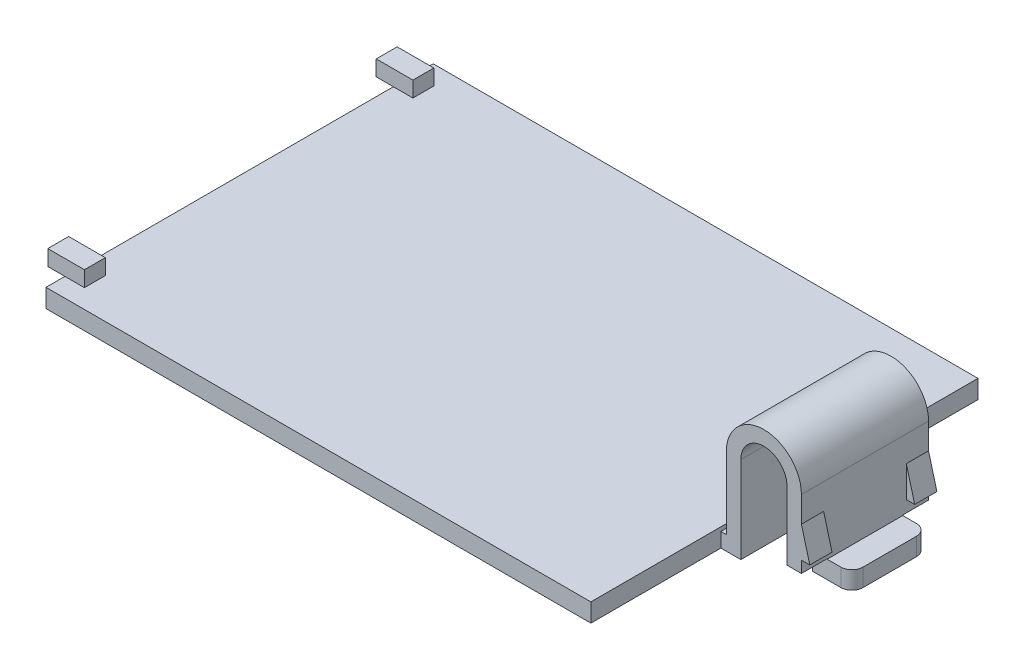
ISO-10303-21;
HEADER;
FILE_DESCRIPTION(('STEP AP214'),'2;1');
FILE_NAME('part.step','',(''),(''),'','','');
FILE_SCHEMA(('AUTOMOTIVE_DESIGN { 1 0 10303 214 1 1 1 1 }'));
ENDSEC;
DATA;
#1=APPLICATION_CONTEXT('core data for automotive mechanical design processes');
#2=APPLICATION_PROTOCOL_DEFINITION('international standard','automotive_design',2000,#1);
#3=PRODUCT_CONTEXT('',#1,'mechanical');
#4=PRODUCT('Part','Part','',(#3));
#5=PRODUCT_RELATED_PRODUCT_CATEGORY('part','',(#4));
#6=PRODUCT_DEFINITION_FORMATION('','',#4);
#7=PRODUCT_DEFINITION_CONTEXT('part definition',#1,'design');
#8=PRODUCT_DEFINITION('design','',#6,#7);
#9=PRODUCT_DEFINITION_SHAPE('','',#8);
#10=(LENGTH_UNIT() NAMED_UNIT(*) SI_UNIT(.MILLI.,.METRE.));
#11=(NAMED_UNIT(*) PLANE_ANGLE_UNIT() SI_UNIT($,.RADIAN.));
#12=(NAMED_UNIT(*) SI_UNIT($,.STERADIAN.) SOLID_ANGLE_UNIT());
#13=UNCERTAINTY_MEASURE_WITH_UNIT(LENGTH_MEASURE(1.E-05),#10,'distance_accuracy_value','');
#14=(GEOMETRIC_REPRESENTATION_CONTEXT(3) GLOBAL_UNCERTAINTY_ASSIGNED_CONTEXT((#13)) GLOBAL_UNIT_ASSIGNED_CONTEXT((#10,
#11,#12)) REPRESENTATION_CONTEXT('',''));
#15=CARTESIAN_POINT('',(0.,0.,0.));
#16=DIRECTION('',(0.,0.,1.));
#17=DIRECTION('',(1.,0.,0.));
#18=AXIS2_PLACEMENT_3D('',#15,#16,#17);
#19=CARTESIAN_POINT('',(7.24909040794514,7.8,5.72));
#20=DIRECTION('',(1.,0.,0.));
#21=DIRECTION('',(0.,0.,-1.));
#22=AXIS2_PLACEMENT_3D('',#19,#20,#21);
#23=PLANE('',#22);
#24=DIRECTION('',(0.,1.,0.));
#25=VECTOR('',#24,1.);
#26=CARTESIAN_POINT('',(7.24909040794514,7.8,5.72));
#27=LINE('',#26,#25);
#28=CARTESIAN_POINT('',(7.24909040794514,7.8,5.72));
#29=VERTEX_POINT('',#28);
#30=CARTESIAN_POINT('',(7.24909040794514,5.48641138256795,5.72));
#31=VERTEX_POINT('',#30);
#32=EDGE_CURVE('E283',#29,#31,#27,.F.);
#33=ORIENTED_EDGE('',*,*,#32,.T.);
#34=DIRECTION('',(0.,0.,1.));
#35=VECTOR('',#34,1.);
#36=CARTESIAN_POINT('',(7.24909040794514,5.48641138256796,3.72));
#37=LINE('',#36,#35);
#38=CARTESIAN_POINT('',(7.24909040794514,5.48641138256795,3.72));
#39=VERTEX_POINT('',#38);
#40=EDGE_CURVE('E44',#39,#31,#37,.T.);
#41=ORIENTED_EDGE('',*,*,#40,.F.);
#42=DIRECTION('',(0.,1.,0.));
#43=VECTOR('',#42,1.);
#44=CARTESIAN_POINT('',(7.24909040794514,5.48641138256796,3.72));
#45=LINE('',#44,#43);
#46=CARTESIAN_POINT('',(7.24909040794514,2.68538830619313,3.72));
#47=VERTEX_POINT('',#46);
#48=EDGE_CURVE('E49',#47,#39,#45,.T.);
#49=ORIENTED_EDGE('',*,*,#48,.F.);
#50=DIRECTION('',(0.,0.,1.));
#51=VECTOR('',#50,1.);
#52=CARTESIAN_POINT('',(7.24909040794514,2.68538830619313,3.72));
#53=LINE('',#52,#51);
#54=CARTESIAN_POINT('',(7.24909040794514,2.68538830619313,5.72));
#55=VERTEX_POINT('',#54);
#56=EDGE_CURVE('E287',#47,#55,#53,.T.);
#57=ORIENTED_EDGE('',*,*,#56,.T.);
#58=CARTESIAN_POINT('',(7.24909040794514,1.64386983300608,5.72));
#59=VERTEX_POINT('',#58);
#60=EDGE_CURVE('E274',#55,#59,#27,.F.);
#61=ORIENTED_EDGE('',*,*,#60,.T.);
#62=DIRECTION('',(0.,0.,1.));
#63=VECTOR('',#62,1.);
#64=CARTESIAN_POINT('',(7.24909040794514,1.64386983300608,5.72));
#65=LINE('',#64,#63);
#66=CARTESIAN_POINT('',(7.24909040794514,1.64386983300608,3.4));
#67=VERTEX_POINT('',#66);
#68=EDGE_CURVE('E334',#67,#59,#65,.T.);
#69=ORIENTED_EDGE('',*,*,#68,.F.);
#70=DIRECTION('',(0.,1.,0.));
#71=VECTOR('',#70,1.);
#72=CARTESIAN_POINT('',(7.24909040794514,1.64386983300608,3.4));
#73=LINE('',#72,#71);
#74=CARTESIAN_POINT('',(7.24909040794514,1.6,3.4));
#75=VERTEX_POINT('',#74);
#76=EDGE_CURVE('E336',#75,#67,#73,.T.);
#77=ORIENTED_EDGE('',*,*,#76,.F.);
#78=DIRECTION('',(0.,0.,1.));
#79=VECTOR('',#78,1.);
#80=CARTESIAN_POINT('',(7.24909040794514,1.6,-3.4));
#81=LINE('',#80,#79);
#82=CARTESIAN_POINT('',(7.24909040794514,1.6,-3.4));
#83=VERTEX_POINT('',#82);
#84=EDGE_CURVE('E368',#83,#75,#81,.T.);
#85=ORIENTED_EDGE('',*,*,#84,.F.);
#86=DIRECTION('',(0.,-1.,0.));
#87=VECTOR('',#86,1.);
#88=CARTESIAN_POINT('',(7.24909040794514,1.64386983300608,-3.4));
#89=LINE('',#88,#87);
#90=CARTESIAN_POINT('',(7.24909040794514,1.64386983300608,-3.4));
#91=VERTEX_POINT('',#90);
#92=EDGE_CURVE('E348',#91,#83,#89,.T.);
#93=ORIENTED_EDGE('',*,*,#92,.F.);
#94=DIRECTION('',(0.,0.,1.));
#95=VECTOR('',#94,1.);
#96=CARTESIAN_POINT('',(7.24909040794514,1.64386983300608,-5.72));
#97=LINE('',#96,#95);
#98=CARTESIAN_POINT('',(7.24909040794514,1.64386983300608,-5.72));
#99=VERTEX_POINT('',#98);
#100=EDGE_CURVE('E345',#99,#91,#97,.T.);
#101=ORIENTED_EDGE('',*,*,#100,.F.);
#102=DIRECTION('',(0.,1.,0.));
#103=VECTOR('',#102,1.);
#104=CARTESIAN_POINT('',(7.24909040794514,7.8,-5.72));
#105=LINE('',#104,#103);
#106=CARTESIAN_POINT('',(7.24909040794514,2.68538830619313,-5.72));
#107=VERTEX_POINT('',#106);
#108=EDGE_CURVE('E397',#107,#99,#105,.F.);
#109=ORIENTED_EDGE('',*,*,#108,.F.);
#110=DIRECTION('',(0.,0.,-1.));
#111=VECTOR('',#110,1.);
#112=CARTESIAN_POINT('',(7.24909040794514,2.68538830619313,-3.72));
#113=LINE('',#112,#111);
#114=CARTESIAN_POINT('',(7.24909040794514,2.68538830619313,-3.72));
#115=VERTEX_POINT('',#114);
#116=EDGE_CURVE('E321',#115,#107,#113,.T.);
#117=ORIENTED_EDGE('',*,*,#116,.F.);
#118=DIRECTION('',(0.,1.,0.));
#119=VECTOR('',#118,1.);
#120=CARTESIAN_POINT('',(7.24909040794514,5.48641138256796,-3.72));
#121=LINE('',#120,#119);
#122=CARTESIAN_POINT('',(7.24909040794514,5.48641138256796,-3.72));
#123=VERTEX_POINT('',#122);
#124=EDGE_CURVE('E311',#115,#123,#121,.T.);
#125=ORIENTED_EDGE('',*,*,#124,.T.);
#126=DIRECTION('',(0.,0.,-1.));
#127=VECTOR('',#126,1.);
#128=CARTESIAN_POINT('',(7.24909040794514,5.48641138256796,-3.72));
#129=LINE('',#128,#127);
#130=CARTESIAN_POINT('',(7.24909040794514,5.48641138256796,-5.72));
#131=VERTEX_POINT('',#130);
#132=EDGE_CURVE('E320',#123,#131,#129,.T.);
#133=ORIENTED_EDGE('',*,*,#132,.T.);
#134=CARTESIAN_POINT('',(7.24909040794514,7.8,-5.72));
#135=VERTEX_POINT('',#134);
#136=EDGE_CURVE('E398',#135,#131,#105,.F.);
#137=ORIENTED_EDGE('',*,*,#136,.F.);
#138=DIRECTION('',(0.,0.,-1.));
#139=VECTOR('',#138,1.);
#140=CARTESIAN_POINT('',(7.24909040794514,7.8,5.72));
#141=LINE('',#140,#139);
#142=EDGE_CURVE('E448',#29,#135,#141,.T.);
#143=ORIENTED_EDGE('',*,*,#142,.F.);
#144=EDGE_LOOP('',(#33,#41,#49,#57,#61,#69,#77,#85,#93,#101,#109,#117,#125,#133,#137,#143));
#145=FACE_BOUND('',#144,.T.);
#146=ADVANCED_FACE('F26',(#145),#23,.T.);
#147=CARTESIAN_POINT('',(0.,1.66,17.42));
#148=DIRECTION('',(-1.,0.,0.));
#149=DIRECTION('',(0.,0.,1.));
#150=AXIS2_PLACEMENT_3D('',#147,#148,#149);
#151=PLANE('',#150);
#152=DIRECTION('',(0.,1.,0.));
#153=VECTOR('',#152,1.);
#154=CARTESIAN_POINT('',(0.,0.,-5.72));
#155=LINE('',#154,#153);
#156=CARTESIAN_POINT('',(0.,0.,-5.72));
#157=VERTEX_POINT('',#156);
#158=CARTESIAN_POINT('',(0.,1.3,-5.72));
#159=VERTEX_POINT('',#158);
#160=EDGE_CURVE('E30',#157,#159,#155,.T.);
#161=ORIENTED_EDGE('',*,*,#160,.F.);
#162=DIRECTION('',(0.,0.,-1.));
#163=VECTOR('',#162,1.);
#164=CARTESIAN_POINT('',(0.,0.,17.42));
#165=LINE('',#164,#163);
#166=CARTESIAN_POINT('',(0.,0.,-17.42));
#167=VERTEX_POINT('',#166);
#168=EDGE_CURVE('E518',#157,#167,#165,.T.);
#169=ORIENTED_EDGE('',*,*,#168,.T.);
#170=DIRECTION('',(0.,-1.,0.));
#171=VECTOR('',#170,1.);
#172=CARTESIAN_POINT('',(0.,1.66,-17.42));
#173=LINE('',#172,#171);
#174=CARTESIAN_POINT('',(0.,1.66,-17.42));
#175=VERTEX_POINT('',#174);
#176=EDGE_CURVE('E530',#175,#167,#173,.T.);
#177=ORIENTED_EDGE('',*,*,#176,.F.);
#178=DIRECTION('',(0.,0.,-1.));
#179=VECTOR('',#178,1.);
#180=CARTESIAN_POINT('',(0.,1.66,17.42));
#181=LINE('',#180,#179);
#182=CARTESIAN_POINT('',(0.,1.66,17.42));
#183=VERTEX_POINT('',#182);
#184=EDGE_CURVE('E553',#183,#175,#181,.T.);
#185=ORIENTED_EDGE('',*,*,#184,.F.);
#186=DIRECTION('',(0.,-1.,0.));
#187=VECTOR('',#186,1.);
#188=CARTESIAN_POINT('',(0.,1.66,17.42));
#189=LINE('',#188,#187);
#190=CARTESIAN_POINT('',(0.,0.,17.42));
#191=VERTEX_POINT('',#190);
#192=EDGE_CURVE('E539',#183,#191,#189,.T.);
#193=ORIENTED_EDGE('',*,*,#192,.T.);
#194=CARTESIAN_POINT('',(0.,0.,5.72));
#195=VERTEX_POINT('',#194);
#196=EDGE_CURVE('E527',#191,#195,#165,.T.);
#197=ORIENTED_EDGE('',*,*,#196,.T.);
#198=DIRECTION('',(0.,1.,0.));
#199=VECTOR('',#198,1.);
#200=CARTESIAN_POINT('',(0.,0.,5.72));
#201=LINE('',#200,#199);
#202=CARTESIAN_POINT('',(0.,1.3,5.72));
#203=VERTEX_POINT('',#202);
#204=EDGE_CURVE('E426',#195,#203,#201,.T.);
#205=ORIENTED_EDGE('',*,*,#204,.T.);
#206=DIRECTION('',(0.,0.,-1.));
#207=VECTOR('',#206,1.);
#208=CARTESIAN_POINT('',(0.,1.3,5.72));
#209=LINE('',#208,#207);
#210=EDGE_CURVE('E441',#203,#159,#209,.T.);
#211=ORIENTED_EDGE('',*,*,#210,.T.);
#212=EDGE_LOOP('',(#161,#169,#177,#185,#193,#197,#205,#211));
#213=FACE_BOUND('',#212,.T.);
#214=ADVANCED_FACE('F28',(#213),#151,.F.);
#215=CARTESIAN_POINT('',(0.,1.66,-17.42));
#216=DIRECTION('',(0.,1.,0.));
#217=DIRECTION('',(0.,0.,1.));
#218=AXIS2_PLACEMENT_3D('',#215,#216,#217);
#219=PLANE('',#218);
#220=DIRECTION('',(0.,0.,-1.));
#221=VECTOR('',#220,1.);
#222=CARTESIAN_POINT('',(-47.2715400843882,1.66,-13.84));
#223=LINE('',#222,#221);
#224=CARTESIAN_POINT('',(-47.2715400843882,1.66,-13.84));
#225=VERTEX_POINT('',#224);
#226=CARTESIAN_POINT('',(-47.2715400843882,1.66,-15.72));
#227=VERTEX_POINT('',#226);
#228=EDGE_CURVE('E455',#225,#227,#223,.T.);
#229=ORIENTED_EDGE('',*,*,#228,.F.);
#230=DIRECTION('',(-1.,0.,0.));
#231=VECTOR('',#230,1.);
#232=CARTESIAN_POINT('',(0.,1.66,-13.84));
#233=LINE('',#232,#231);
#234=CARTESIAN_POINT('',(-49.03,1.66,-13.84));
#235=VERTEX_POINT('',#234);
#236=EDGE_CURVE('E11',#225,#235,#233,.T.);
#237=ORIENTED_EDGE('',*,*,#236,.T.);
#238=DIRECTION('',(0.,0.,1.));
#239=VECTOR('',#238,1.);
#240=CARTESIAN_POINT('',(-49.03,1.66,17.42));
#241=LINE('',#240,#239);
#242=CARTESIAN_POINT('',(-49.03,1.66,13.84));
#243=VERTEX_POINT('',#242);
#244=EDGE_CURVE('E548',#235,#243,#241,.T.);
#245=ORIENTED_EDGE('',*,*,#244,.T.);
#246=DIRECTION('',(-1.,0.,0.));
#247=VECTOR('',#246,1.);
#248=CARTESIAN_POINT('',(-50.5715400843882,1.66,13.84));
#249=LINE('',#248,#247);
#250=CARTESIAN_POINT('',(-47.2715400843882,1.66,13.84));
#251=VERTEX_POINT('',#250);
#252=EDGE_CURVE('E494',#251,#243,#249,.T.);
#253=ORIENTED_EDGE('',*,*,#252,.F.);
#254=DIRECTION('',(0.,0.,-1.));
#255=VECTOR('',#254,1.);
#256=CARTESIAN_POINT('',(-47.2715400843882,1.66,13.84));
#257=LINE('',#256,#255);
#258=CARTESIAN_POINT('',(-47.2715400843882,1.66,15.72));
#259=VERTEX_POINT('',#258);
#260=EDGE_CURVE('E490',#259,#251,#257,.T.);
#261=ORIENTED_EDGE('',*,*,#260,.F.);
#262=DIRECTION('',(1.,0.,0.));
#263=VECTOR('',#262,1.);
#264=CARTESIAN_POINT('',(-50.5715400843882,1.66,15.72));
#265=LINE('',#264,#263);
#266=CARTESIAN_POINT('',(-49.03,1.66,15.72));
#267=VERTEX_POINT('',#266);
#268=EDGE_CURVE('E36',#267,#259,#265,.T.);
#269=ORIENTED_EDGE('',*,*,#268,.F.);
#270=CARTESIAN_POINT('',(-49.03,1.66,17.42));
#271=VERTEX_POINT('',#270);
#272=EDGE_CURVE('E552',#267,#271,#241,.T.);
#273=ORIENTED_EDGE('',*,*,#272,.T.);
#274=DIRECTION('',(1.,0.,0.));
#275=VECTOR('',#274,1.);
#276=CARTESIAN_POINT('',(0.,1.66,17.42));
#277=LINE('',#276,#275);
#278=EDGE_CURVE('E542',#271,#183,#277,.T.);
#279=ORIENTED_EDGE('',*,*,#278,.T.);
#280=ORIENTED_EDGE('',*,*,#184,.T.);
#281=DIRECTION('',(-1.,0.,0.));
#282=VECTOR('',#281,1.);
#283=CARTESIAN_POINT('',(0.,1.66,-17.42));
#284=LINE('',#283,#282);
#285=CARTESIAN_POINT('',(-49.03,1.66,-17.42));
#286=VERTEX_POINT('',#285);
#287=EDGE_CURVE('E550',#175,#286,#284,.T.);
#288=ORIENTED_EDGE('',*,*,#287,.T.);
#289=CARTESIAN_POINT('',(-49.03,1.66,-15.72));
#290=VERTEX_POINT('',#289);
#291=EDGE_CURVE('E544',#286,#290,#241,.T.);
#292=ORIENTED_EDGE('',*,*,#291,.T.);
#293=DIRECTION('',(-1.,0.,0.));
#294=VECTOR('',#293,1.);
#295=CARTESIAN_POINT('',(-50.5715400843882,1.66,-15.72));
#296=LINE('',#295,#294);
#297=EDGE_CURVE('E459',#227,#290,#296,.T.);
#298=ORIENTED_EDGE('',*,*,#297,.F.);
#299=EDGE_LOOP('',(#229,#237,#245,#253,#261,#269,#273,#279,#280,#288,#292,#298));
#300=FACE_BOUND('',#299,.T.);
#301=ADVANCED_FACE('F584',(#300),#219,.T.);
#302=CARTESIAN_POINT('',(0.,1.66,-17.42));
#303=DIRECTION('',(0.,0.,1.));
#304=DIRECTION('',(1.,0.,0.));
#305=AXIS2_PLACEMENT_3D('',#302,#303,#304);
#306=PLANE('',#305);
#307=DIRECTION('',(-1.,0.,0.));
#308=VECTOR('',#307,1.);
#309=CARTESIAN_POINT('',(0.,0.,-17.42));
#310=LINE('',#309,#308);
#311=CARTESIAN_POINT('',(-49.03,0.,-17.42));
#312=VERTEX_POINT('',#311);
#313=EDGE_CURVE('E521',#167,#312,#310,.T.);
#314=ORIENTED_EDGE('',*,*,#313,.T.);
#315=DIRECTION('',(0.,-1.,0.));
#316=VECTOR('',#315,1.);
#317=CARTESIAN_POINT('',(-49.03,1.66,-17.42));
#318=LINE('',#317,#316);
#319=EDGE_CURVE('E533',#286,#312,#318,.T.);
#320=ORIENTED_EDGE('',*,*,#319,.F.);
#321=ORIENTED_EDGE('',*,*,#287,.F.);
#322=ORIENTED_EDGE('',*,*,#176,.T.);
#323=EDGE_LOOP('',(#314,#320,#321,#322));
#324=FACE_BOUND('',#323,.T.);
#325=ADVANCED_FACE('F564',(#324),#306,.F.);
#326=CARTESIAN_POINT('',(-49.03,1.66,17.42));
#327=DIRECTION('',(1.,0.,0.));
#328=DIRECTION('',(0.,0.,-1.));
#329=AXIS2_PLACEMENT_3D('',#326,#327,#328);
#330=PLANE('',#329);
#331=DIRECTION('',(0.,0.,1.));
#332=VECTOR('',#331,1.);
#333=CARTESIAN_POINT('',(-49.03,0.,17.42));
#334=LINE('',#333,#332);
#335=CARTESIAN_POINT('',(-49.03,0.,17.42));
#336=VERTEX_POINT('',#335);
#337=EDGE_CURVE('E557',#312,#336,#334,.T.);
#338=ORIENTED_EDGE('',*,*,#337,.T.);
#339=DIRECTION('',(0.,-1.,0.));
#340=VECTOR('',#339,1.);
#341=CARTESIAN_POINT('',(-49.03,1.66,17.42));
#342=LINE('',#341,#340);
#343=EDGE_CURVE('E536',#271,#336,#342,.T.);
#344=ORIENTED_EDGE('',*,*,#343,.F.);
#345=ORIENTED_EDGE('',*,*,#272,.F.);
#346=EDGE_CURVE('E549',#243,#267,#241,.T.);
#347=ORIENTED_EDGE('',*,*,#346,.F.);
#348=ORIENTED_EDGE('',*,*,#244,.F.);
#349=EDGE_CURVE('E547',#290,#235,#241,.T.);
#350=ORIENTED_EDGE('',*,*,#349,.F.);
#351=ORIENTED_EDGE('',*,*,#291,.F.);
#352=ORIENTED_EDGE('',*,*,#319,.T.);
#353=EDGE_LOOP('',(#338,#344,#345,#347,#348,#350,#351,#352));
#354=FACE_BOUND('',#353,.T.);
#355=ADVANCED_FACE('F569',(#354),#330,.F.);
#356=CARTESIAN_POINT('',(0.,1.66,17.42));
#357=DIRECTION('',(0.,0.,-1.));
#358=DIRECTION('',(-1.,0.,0.));
#359=AXIS2_PLACEMENT_3D('',#356,#357,#358);
#360=PLANE('',#359);
#361=DIRECTION('',(1.,0.,0.));
#362=VECTOR('',#361,1.);
#363=CARTESIAN_POINT('',(0.,0.,17.42));
#364=LINE('',#363,#362);
#365=EDGE_CURVE('E556',#336,#191,#364,.T.);
#366=ORIENTED_EDGE('',*,*,#365,.T.);
#367=ORIENTED_EDGE('',*,*,#192,.F.);
#368=ORIENTED_EDGE('',*,*,#278,.F.);
#369=ORIENTED_EDGE('',*,*,#343,.T.);
#370=EDGE_LOOP('',(#366,#367,#368,#369));
#371=FACE_BOUND('',#370,.T.);
#372=ADVANCED_FACE('F576',(#371),#360,.F.);
#373=CARTESIAN_POINT('',(0.,0.,-17.42));
#374=DIRECTION('',(0.,1.,0.));
#375=DIRECTION('',(0.,0.,1.));
#376=AXIS2_PLACEMENT_3D('',#373,#374,#375);
#377=PLANE('',#376);
#378=ORIENTED_EDGE('',*,*,#196,.F.);
#379=ORIENTED_EDGE('',*,*,#365,.F.);
#380=ORIENTED_EDGE('',*,*,#337,.F.);
#381=ORIENTED_EDGE('',*,*,#313,.F.);
#382=ORIENTED_EDGE('',*,*,#168,.F.);
#383=DIRECTION('',(1.,0.,0.));
#384=VECTOR('',#383,1.);
#385=CARTESIAN_POINT('',(0.,0.,-5.72));
#386=LINE('',#385,#384);
#387=CARTESIAN_POINT('',(1.79857073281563,0.,-5.72));
#388=VERTEX_POINT('',#387);
#389=EDGE_CURVE('E414',#157,#388,#386,.T.);
#390=ORIENTED_EDGE('',*,*,#389,.T.);
#391=DIRECTION('',(0.,0.,-1.));
#392=VECTOR('',#391,1.);
#393=CARTESIAN_POINT('',(1.79857073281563,0.,5.72));
#394=LINE('',#393,#392);
#395=CARTESIAN_POINT('',(1.79857073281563,0.,5.72));
#396=VERTEX_POINT('',#395);
#397=EDGE_CURVE('E438',#396,#388,#394,.T.);
#398=ORIENTED_EDGE('',*,*,#397,.F.);
#399=DIRECTION('',(1.,0.,0.));
#400=VECTOR('',#399,1.);
#401=CARTESIAN_POINT('',(0.,0.,5.72));
#402=LINE('',#401,#400);
#403=EDGE_CURVE('E430',#195,#396,#402,.T.);
#404=ORIENTED_EDGE('',*,*,#403,.F.);
#405=EDGE_LOOP('',(#378,#379,#380,#381,#382,#390,#398,#404));
#406=FACE_BOUND('',#405,.T.);
#407=ADVANCED_FACE('F573',(#406),#377,.F.);
#408=CARTESIAN_POINT('',(-50.5715400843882,1.66,15.72));
#409=DIRECTION('',(0.,1.,0.));
#410=DIRECTION('',(0.,0.,1.));
#411=AXIS2_PLACEMENT_3D('',#408,#409,#410);
#412=PLANE('',#411);
#413=CARTESIAN_POINT('',(-50.5715400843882,1.66,13.84));
#414=VERTEX_POINT('',#413);
#415=EDGE_CURVE('E493',#243,#414,#249,.T.);
#416=ORIENTED_EDGE('',*,*,#415,.F.);
#417=ORIENTED_EDGE('',*,*,#346,.T.);
#418=CARTESIAN_POINT('',(-50.5715400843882,1.66,15.72));
#419=VERTEX_POINT('',#418);
#420=EDGE_CURVE('E487',#419,#267,#265,.T.);
#421=ORIENTED_EDGE('',*,*,#420,.F.);
#422=DIRECTION('',(0.,0.,1.));
#423=VECTOR('',#422,1.);
#424=CARTESIAN_POINT('',(-50.5715400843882,1.66,13.84));
#425=LINE('',#424,#423);
#426=EDGE_CURVE('E484',#414,#419,#425,.T.);
#427=ORIENTED_EDGE('',*,*,#426,.F.);
#428=EDGE_LOOP('',(#416,#417,#421,#427));
#429=FACE_BOUND('',#428,.T.);
#430=ADVANCED_FACE('F595',(#429),#412,.F.);
#431=CARTESIAN_POINT('',(-50.5715400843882,3.06,13.84));
#432=DIRECTION('',(1.,0.,0.));
#433=DIRECTION('',(0.,0.,-1.));
#434=AXIS2_PLACEMENT_3D('',#431,#432,#433);
#435=PLANE('',#434);
#436=ORIENTED_EDGE('',*,*,#426,.T.);
#437=DIRECTION('',(0.,-1.,0.));
#438=VECTOR('',#437,1.);
#439=CARTESIAN_POINT('',(-50.5715400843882,3.06,15.72));
#440=LINE('',#439,#438);
#441=CARTESIAN_POINT('',(-50.5715400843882,3.06,15.72));
#442=VERTEX_POINT('',#441);
#443=EDGE_CURVE('E515',#442,#419,#440,.T.);
#444=ORIENTED_EDGE('',*,*,#443,.F.);
#445=DIRECTION('',(0.,0.,1.));
#446=VECTOR('',#445,1.);
#447=CARTESIAN_POINT('',(-50.5715400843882,3.06,13.84));
#448=LINE('',#447,#446);
#449=CARTESIAN_POINT('',(-50.5715400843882,3.06,13.84));
#450=VERTEX_POINT('',#449);
#451=EDGE_CURVE('E497',#450,#442,#448,.T.);
#452=ORIENTED_EDGE('',*,*,#451,.F.);
#453=DIRECTION('',(0.,-1.,0.));
#454=VECTOR('',#453,1.);
#455=CARTESIAN_POINT('',(-50.5715400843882,3.06,13.84));
#456=LINE('',#455,#454);
#457=EDGE_CURVE('E506',#450,#414,#456,.T.);
#458=ORIENTED_EDGE('',*,*,#457,.T.);
#459=EDGE_LOOP('',(#436,#444,#452,#458));
#460=FACE_BOUND('',#459,.T.);
#461=ADVANCED_FACE('F610',(#460),#435,.F.);
#462=CARTESIAN_POINT('',(-50.5715400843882,3.06,15.72));
#463=DIRECTION('',(0.,0.,-1.));
#464=DIRECTION('',(-1.,0.,0.));
#465=AXIS2_PLACEMENT_3D('',#462,#463,#464);
#466=PLANE('',#465);
#467=ORIENTED_EDGE('',*,*,#420,.T.);
#468=ORIENTED_EDGE('',*,*,#268,.T.);
#469=DIRECTION('',(0.,-1.,0.));
#470=VECTOR('',#469,1.);
#471=CARTESIAN_POINT('',(-47.2715400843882,3.06,15.72));
#472=LINE('',#471,#470);
#473=CARTESIAN_POINT('',(-47.2715400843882,3.06,15.72));
#474=VERTEX_POINT('',#473);
#475=EDGE_CURVE('E512',#474,#259,#472,.T.);
#476=ORIENTED_EDGE('',*,*,#475,.F.);
#477=DIRECTION('',(1.,0.,0.));
#478=VECTOR('',#477,1.);
#479=CARTESIAN_POINT('',(-50.5715400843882,3.06,15.72));
#480=LINE('',#479,#478);
#481=EDGE_CURVE('E500',#442,#474,#480,.T.);
#482=ORIENTED_EDGE('',*,*,#481,.F.);
#483=ORIENTED_EDGE('',*,*,#443,.T.);
#484=EDGE_LOOP('',(#467,#468,#476,#482,#483));
#485=FACE_BOUND('',#484,.T.);
#486=ADVANCED_FACE('F606',(#485),#466,.F.);
#487=CARTESIAN_POINT('',(-47.2715400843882,3.06,13.84));
#488=DIRECTION('',(-1.,0.,0.));
#489=DIRECTION('',(0.,0.,1.));
#490=AXIS2_PLACEMENT_3D('',#487,#488,#489);
#491=PLANE('',#490);
#492=ORIENTED_EDGE('',*,*,#260,.T.);
#493=DIRECTION('',(0.,-1.,0.));
#494=VECTOR('',#493,1.);
#495=CARTESIAN_POINT('',(-47.2715400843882,3.06,13.84));
#496=LINE('',#495,#494);
#497=CARTESIAN_POINT('',(-47.2715400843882,3.06,13.84));
#498=VERTEX_POINT('',#497);
#499=EDGE_CURVE('E509',#498,#251,#496,.T.);
#500=ORIENTED_EDGE('',*,*,#499,.F.);
#501=DIRECTION('',(0.,0.,-1.));
#502=VECTOR('',#501,1.);
#503=CARTESIAN_POINT('',(-47.2715400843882,3.06,13.84));
#504=LINE('',#503,#502);
#505=EDGE_CURVE('E502',#474,#498,#504,.T.);
#506=ORIENTED_EDGE('',*,*,#505,.F.);
#507=ORIENTED_EDGE('',*,*,#475,.T.);
#508=EDGE_LOOP('',(#492,#500,#506,#507));
#509=FACE_BOUND('',#508,.T.);
#510=ADVANCED_FACE('F603',(#509),#491,.F.);
#511=CARTESIAN_POINT('',(-50.5715400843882,3.06,13.84));
#512=DIRECTION('',(0.,0.,1.));
#513=DIRECTION('',(1.,0.,0.));
#514=AXIS2_PLACEMENT_3D('',#511,#512,#513);
#515=PLANE('',#514);
#516=ORIENTED_EDGE('',*,*,#252,.T.);
#517=ORIENTED_EDGE('',*,*,#415,.T.);
#518=ORIENTED_EDGE('',*,*,#457,.F.);
#519=DIRECTION('',(-1.,0.,0.));
#520=VECTOR('',#519,1.);
#521=CARTESIAN_POINT('',(-50.5715400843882,3.06,13.84));
#522=LINE('',#521,#520);
#523=EDGE_CURVE('E504',#498,#450,#522,.T.);
#524=ORIENTED_EDGE('',*,*,#523,.F.);
#525=ORIENTED_EDGE('',*,*,#499,.T.);
#526=EDGE_LOOP('',(#516,#517,#518,#524,#525));
#527=FACE_BOUND('',#526,.T.);
#528=ADVANCED_FACE('F598',(#527),#515,.F.);
#529=CARTESIAN_POINT('',(-50.5715400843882,3.06,15.72));
#530=DIRECTION('',(0.,1.,0.));
#531=DIRECTION('',(0.,0.,1.));
#532=AXIS2_PLACEMENT_3D('',#529,#530,#531);
#533=PLANE('',#532);
#534=ORIENTED_EDGE('',*,*,#451,.T.);
#535=ORIENTED_EDGE('',*,*,#481,.T.);
#536=ORIENTED_EDGE('',*,*,#505,.T.);
#537=ORIENTED_EDGE('',*,*,#523,.T.);
#538=EDGE_LOOP('',(#534,#535,#536,#537));
#539=FACE_BOUND('',#538,.T.);
#540=ADVANCED_FACE('F612',(#539),#533,.T.);
#541=CARTESIAN_POINT('',(-50.5715400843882,1.66,-13.84));
#542=DIRECTION('',(0.,1.,0.));
#543=DIRECTION('',(0.,0.,1.));
#544=AXIS2_PLACEMENT_3D('',#541,#542,#543);
#545=PLANE('',#544);
#546=CARTESIAN_POINT('',(-50.5715400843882,1.66,-15.72));
#547=VERTEX_POINT('',#546);
#548=EDGE_CURVE('E458',#290,#547,#296,.T.);
#549=ORIENTED_EDGE('',*,*,#548,.F.);
#550=ORIENTED_EDGE('',*,*,#349,.T.);
#551=DIRECTION('',(1.,0.,0.));
#552=VECTOR('',#551,1.);
#553=CARTESIAN_POINT('',(-50.5715400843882,1.66,-13.84));
#554=LINE('',#553,#552);
#555=CARTESIAN_POINT('',(-50.5715400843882,1.66,-13.84));
#556=VERTEX_POINT('',#555);
#557=EDGE_CURVE('E452',#556,#235,#554,.T.);
#558=ORIENTED_EDGE('',*,*,#557,.F.);
#559=DIRECTION('',(0.,0.,1.));
#560=VECTOR('',#559,1.);
#561=CARTESIAN_POINT('',(-50.5715400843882,1.66,-13.84));
#562=LINE('',#561,#560);
#563=EDGE_CURVE('E462',#547,#556,#562,.T.);
#564=ORIENTED_EDGE('',*,*,#563,.F.);
#565=EDGE_LOOP('',(#549,#550,#558,#564));
#566=FACE_BOUND('',#565,.T.);
#567=ADVANCED_FACE('F614',(#566),#545,.F.);
#568=CARTESIAN_POINT('',(-50.5715400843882,3.06,-13.84));
#569=DIRECTION('',(0.,0.,-1.));
#570=DIRECTION('',(-1.,0.,0.));
#571=AXIS2_PLACEMENT_3D('',#568,#569,#570);
#572=PLANE('',#571);
#573=ORIENTED_EDGE('',*,*,#557,.T.);
#574=ORIENTED_EDGE('',*,*,#236,.F.);
#575=DIRECTION('',(0.,-1.,0.));
#576=VECTOR('',#575,1.);
#577=CARTESIAN_POINT('',(-47.2715400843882,3.06,-13.84));
#578=LINE('',#577,#576);
#579=CARTESIAN_POINT('',(-47.2715400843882,3.06,-13.84));
#580=VERTEX_POINT('',#579);
#581=EDGE_CURVE('E481',#580,#225,#578,.T.);
#582=ORIENTED_EDGE('',*,*,#581,.F.);
#583=DIRECTION('',(1.,0.,0.));
#584=VECTOR('',#583,1.);
#585=CARTESIAN_POINT('',(-50.5715400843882,3.06,-13.84));
#586=LINE('',#585,#584);
#587=CARTESIAN_POINT('',(-50.5715400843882,3.06,-13.84));
#588=VERTEX_POINT('',#587);
#589=EDGE_CURVE('E464',#588,#580,#586,.T.);
#590=ORIENTED_EDGE('',*,*,#589,.F.);
#591=DIRECTION('',(0.,-1.,0.));
#592=VECTOR('',#591,1.);
#593=CARTESIAN_POINT('',(-50.5715400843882,3.06,-13.84));
#594=LINE('',#593,#592);
#595=EDGE_CURVE('E473',#588,#556,#594,.T.);
#596=ORIENTED_EDGE('',*,*,#595,.T.);
#597=EDGE_LOOP('',(#573,#574,#582,#590,#596));
#598=FACE_BOUND('',#597,.T.);
#599=ADVANCED_FACE('F620',(#598),#572,.F.);
#600=CARTESIAN_POINT('',(-47.2715400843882,3.06,-13.84));
#601=DIRECTION('',(-1.,0.,0.));
#602=DIRECTION('',(0.,0.,1.));
#603=AXIS2_PLACEMENT_3D('',#600,#601,#602);
#604=PLANE('',#603);
#605=ORIENTED_EDGE('',*,*,#228,.T.);
#606=DIRECTION('',(0.,-1.,0.));
#607=VECTOR('',#606,1.);
#608=CARTESIAN_POINT('',(-47.2715400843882,3.06,-15.72));
#609=LINE('',#608,#607);
#610=CARTESIAN_POINT('',(-47.2715400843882,3.06,-15.72));
#611=VERTEX_POINT('',#610);
#612=EDGE_CURVE('E479',#611,#227,#609,.T.);
#613=ORIENTED_EDGE('',*,*,#612,.F.);
#614=DIRECTION('',(0.,0.,-1.));
#615=VECTOR('',#614,1.);
#616=CARTESIAN_POINT('',(-47.2715400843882,3.06,-13.84));
#617=LINE('',#616,#615);
#618=EDGE_CURVE('E467',#580,#611,#617,.T.);
#619=ORIENTED_EDGE('',*,*,#618,.F.);
#620=ORIENTED_EDGE('',*,*,#581,.T.);
#621=EDGE_LOOP('',(#605,#613,#619,#620));
#622=FACE_BOUND('',#621,.T.);
#623=ADVANCED_FACE('F654',(#622),#604,.F.);
#624=CARTESIAN_POINT('',(-50.5715400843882,3.06,-15.72));
#625=DIRECTION('',(0.,0.,1.));
#626=DIRECTION('',(1.,0.,0.));
#627=AXIS2_PLACEMENT_3D('',#624,#625,#626);
#628=PLANE('',#627);
#629=ORIENTED_EDGE('',*,*,#297,.T.);
#630=ORIENTED_EDGE('',*,*,#548,.T.);
#631=DIRECTION('',(0.,-1.,0.));
#632=VECTOR('',#631,1.);
#633=CARTESIAN_POINT('',(-50.5715400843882,3.06,-15.72));
#634=LINE('',#633,#632);
#635=CARTESIAN_POINT('',(-50.5715400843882,3.06,-15.72));
#636=VERTEX_POINT('',#635);
#637=EDGE_CURVE('E476',#636,#547,#634,.T.);
#638=ORIENTED_EDGE('',*,*,#637,.F.);
#639=DIRECTION('',(-1.,0.,0.));
#640=VECTOR('',#639,1.);
#641=CARTESIAN_POINT('',(-50.5715400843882,3.06,-15.72));
#642=LINE('',#641,#640);
#643=EDGE_CURVE('E469',#611,#636,#642,.T.);
#644=ORIENTED_EDGE('',*,*,#643,.F.);
#645=ORIENTED_EDGE('',*,*,#612,.T.);
#646=EDGE_LOOP('',(#629,#630,#638,#644,#645));
#647=FACE_BOUND('',#646,.T.);
#648=ADVANCED_FACE('F650',(#647),#628,.F.);
#649=CARTESIAN_POINT('',(-50.5715400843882,3.06,-13.84));
#650=DIRECTION('',(1.,0.,0.));
#651=DIRECTION('',(0.,0.,-1.));
#652=AXIS2_PLACEMENT_3D('',#649,#650,#651);
#653=PLANE('',#652);
#654=ORIENTED_EDGE('',*,*,#563,.T.);
#655=ORIENTED_EDGE('',*,*,#595,.F.);
#656=DIRECTION('',(0.,0.,1.));
#657=VECTOR('',#656,1.);
#658=CARTESIAN_POINT('',(-50.5715400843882,3.06,-13.84));
#659=LINE('',#658,#657);
#660=EDGE_CURVE('E471',#636,#588,#659,.T.);
#661=ORIENTED_EDGE('',*,*,#660,.F.);
#662=ORIENTED_EDGE('',*,*,#637,.T.);
#663=EDGE_LOOP('',(#654,#655,#661,#662));
#664=FACE_BOUND('',#663,.T.);
#665=ADVANCED_FACE('F646',(#664),#653,.F.);
#666=CARTESIAN_POINT('',(-50.5715400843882,3.06,-13.84));
#667=DIRECTION('',(0.,1.,0.));
#668=DIRECTION('',(0.,0.,1.));
#669=AXIS2_PLACEMENT_3D('',#666,#667,#668);
#670=PLANE('',#669);
#671=ORIENTED_EDGE('',*,*,#589,.T.);
#672=ORIENTED_EDGE('',*,*,#618,.T.);
#673=ORIENTED_EDGE('',*,*,#643,.T.);
#674=ORIENTED_EDGE('',*,*,#660,.T.);
#675=EDGE_LOOP('',(#671,#672,#673,#674));
#676=FACE_BOUND('',#675,.T.);
#677=ADVANCED_FACE('F641',(#676),#670,.T.);
#678=CARTESIAN_POINT('',(5.94909040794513,7.8,5.72));
#679=DIRECTION('',(1.,0.,0.));
#680=DIRECTION('',(0.,0.,-1.));
#681=AXIS2_PLACEMENT_3D('',#678,#679,#680);
#682=PLANE('',#681);
#683=DIRECTION('',(0.,-1.,0.));
#684=VECTOR('',#683,1.);
#685=CARTESIAN_POINT('',(5.94909040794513,1.64386983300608,3.4));
#686=LINE('',#685,#684);
#687=CARTESIAN_POINT('',(5.94909040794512,1.64386983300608,3.4));
#688=VERTEX_POINT('',#687);
#689=CARTESIAN_POINT('',(5.94909040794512,0.,3.4));
#690=VERTEX_POINT('',#689);
#691=EDGE_CURVE('E324',#688,#690,#686,.T.);
#692=ORIENTED_EDGE('',*,*,#691,.F.);
#693=DIRECTION('',(0.,0.,-1.));
#694=VECTOR('',#693,1.);
#695=CARTESIAN_POINT('',(5.94909040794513,1.64386983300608,5.72));
#696=LINE('',#695,#694);
#697=CARTESIAN_POINT('',(5.94909040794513,1.64386983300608,5.72));
#698=VERTEX_POINT('',#697);
#699=EDGE_CURVE('E331',#698,#688,#696,.T.);
#700=ORIENTED_EDGE('',*,*,#699,.F.);
#701=DIRECTION('',(0.,-1.,0.));
#702=VECTOR('',#701,1.);
#703=CARTESIAN_POINT('',(5.94909040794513,7.8,5.72));
#704=LINE('',#703,#702);
#705=CARTESIAN_POINT('',(5.94909040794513,7.8,5.72));
#706=VERTEX_POINT('',#705);
#707=EDGE_CURVE('E284',#706,#698,#704,.T.);
#708=ORIENTED_EDGE('',*,*,#707,.F.);
#709=DIRECTION('',(0.,0.,-1.));
#710=VECTOR('',#709,1.);
#711=CARTESIAN_POINT('',(5.94909040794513,7.8,5.72));
#712=LINE('',#711,#710);
#713=CARTESIAN_POINT('',(5.94909040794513,7.8,-5.72));
#714=VERTEX_POINT('',#713);
#715=EDGE_CURVE('E432',#706,#714,#712,.T.);
#716=ORIENTED_EDGE('',*,*,#715,.T.);
#717=DIRECTION('',(0.,-1.,0.));
#718=VECTOR('',#717,1.);
#719=CARTESIAN_POINT('',(5.94909040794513,7.8,-5.72));
#720=LINE('',#719,#718);
#721=CARTESIAN_POINT('',(5.94909040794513,1.64386983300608,-5.72));
#722=VERTEX_POINT('',#721);
#723=EDGE_CURVE('E394',#714,#722,#720,.T.);
#724=ORIENTED_EDGE('',*,*,#723,.T.);
#725=DIRECTION('',(0.,0.,-1.));
#726=VECTOR('',#725,1.);
#727=CARTESIAN_POINT('',(5.94909040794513,1.64386983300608,-5.72));
#728=LINE('',#727,#726);
#729=CARTESIAN_POINT('',(5.94909040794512,1.64386983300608,-3.4));
#730=VERTEX_POINT('',#729);
#731=EDGE_CURVE('E353',#730,#722,#728,.T.);
#732=ORIENTED_EDGE('',*,*,#731,.F.);
#733=DIRECTION('',(0.,1.,0.));
#734=VECTOR('',#733,1.);
#735=CARTESIAN_POINT('',(5.94909040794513,1.64386983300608,-3.4));
#736=LINE('',#735,#734);
#737=CARTESIAN_POINT('',(5.94909040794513,0.,-3.4));
#738=VERTEX_POINT('',#737);
#739=EDGE_CURVE('E341',#738,#730,#736,.T.);
#740=ORIENTED_EDGE('',*,*,#739,.F.);
#741=DIRECTION('',(0.,0.,-1.));
#742=VECTOR('',#741,1.);
#743=CARTESIAN_POINT('',(5.94909040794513,0.,5.72));
#744=LINE('',#743,#742);
#745=EDGE_CURVE('E450',#690,#738,#744,.T.);
#746=ORIENTED_EDGE('',*,*,#745,.F.);
#747=EDGE_LOOP('',(#692,#700,#708,#716,#724,#732,#740,#746));
#748=FACE_BOUND('',#747,.T.);
#749=ADVANCED_FACE('F638',(#748),#682,.F.);
#750=CARTESIAN_POINT('',(7.24909040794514,0.,5.72));
#751=DIRECTION('',(0.,-1.,0.));
#752=DIRECTION('',(0.,0.,-1.));
#753=AXIS2_PLACEMENT_3D('',#750,#751,#752);
#754=PLANE('',#753);
#755=DIRECTION('',(1.,0.,0.));
#756=VECTOR('',#755,1.);
#757=CARTESIAN_POINT('',(7.24909040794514,0.,3.4));
#758=LINE('',#757,#756);
#759=CARTESIAN_POINT('',(8.47520421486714,0.,3.4));
#760=VERTEX_POINT('',#759);
#761=EDGE_CURVE('E357',#690,#760,#758,.T.);
#762=ORIENTED_EDGE('',*,*,#761,.F.);
#763=ORIENTED_EDGE('',*,*,#745,.T.);
#764=DIRECTION('',(-1.,0.,0.));
#765=VECTOR('',#764,1.);
#766=CARTESIAN_POINT('',(7.24909040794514,0.,-3.4));
#767=LINE('',#766,#765);
#768=CARTESIAN_POINT('',(8.47520421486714,0.,-3.4));
#769=VERTEX_POINT('',#768);
#770=EDGE_CURVE('E365',#769,#738,#767,.T.);
#771=ORIENTED_EDGE('',*,*,#770,.F.);
#772=CARTESIAN_POINT('',(8.47520421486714,0.,-2.4));
#773=DIRECTION('',(0.,1.,0.));
#774=DIRECTION('',(0.,0.,-1.));
#775=AXIS2_PLACEMENT_3D('',#772,#773,#774);
#776=CIRCLE('',#775,1.);
#777=CARTESIAN_POINT('',(9.47520421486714,0.,-2.4));
#778=VERTEX_POINT('',#777);
#779=EDGE_CURVE('E363',#778,#769,#776,.T.);
#780=ORIENTED_EDGE('',*,*,#779,.F.);
#781=DIRECTION('',(0.,0.,-1.));
#782=VECTOR('',#781,1.);
#783=CARTESIAN_POINT('',(9.47520421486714,0.,-2.4));
#784=LINE('',#783,#782);
#785=CARTESIAN_POINT('',(9.47520421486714,0.,2.4));
#786=VERTEX_POINT('',#785);
#787=EDGE_CURVE('E361',#786,#778,#784,.T.);
#788=ORIENTED_EDGE('',*,*,#787,.F.);
#789=CARTESIAN_POINT('',(8.47520421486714,0.,2.4));
#790=DIRECTION('',(0.,1.,0.));
#791=DIRECTION('',(0.,0.,1.));
#792=AXIS2_PLACEMENT_3D('',#789,#790,#791);
#793=CIRCLE('',#792,1.);
#794=EDGE_CURVE('E359',#760,#786,#793,.T.);
#795=ORIENTED_EDGE('',*,*,#794,.F.);
#796=EDGE_LOOP('',(#762,#763,#771,#780,#788,#795));
#797=FACE_BOUND('',#796,.T.);
#798=ADVANCED_FACE('F635',(#797),#754,.T.);
#799=CARTESIAN_POINT('',(3.87383057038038,7.8,5.72));
#800=DIRECTION('',(0.,0.,-1.));
#801=DIRECTION('',(-1.,0.,0.));
#802=AXIS2_PLACEMENT_3D('',#799,#800,#801);
#803=CYLINDRICAL_SURFACE('',#802,3.37525983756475);
#804=CARTESIAN_POINT('',(3.87383057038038,7.8,-5.72));
#805=DIRECTION('',(0.,0.,1.));
#806=DIRECTION('',(1.,0.,0.));
#807=AXIS2_PLACEMENT_3D('',#804,#805,#806);
#808=CIRCLE('',#807,3.37525983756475);
#809=CARTESIAN_POINT('',(0.498570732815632,7.8,-5.72));
#810=VERTEX_POINT('',#809);
#811=EDGE_CURVE('E401',#810,#135,#808,.F.);
#812=ORIENTED_EDGE('',*,*,#811,.F.);
#813=DIRECTION('',(0.,0.,-1.));
#814=VECTOR('',#813,1.);
#815=CARTESIAN_POINT('',(0.498570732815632,7.8,5.72));
#816=LINE('',#815,#814);
#817=CARTESIAN_POINT('',(0.498570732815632,7.8,5.72));
#818=VERTEX_POINT('',#817);
#819=EDGE_CURVE('E446',#818,#810,#816,.T.);
#820=ORIENTED_EDGE('',*,*,#819,.F.);
#821=CARTESIAN_POINT('',(3.87383057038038,7.8,5.72));
#822=DIRECTION('',(0.,0.,1.));
#823=DIRECTION('',(1.,0.,0.));
#824=AXIS2_PLACEMENT_3D('',#821,#822,#823);
#825=CIRCLE('',#824,3.37525983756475);
#826=EDGE_CURVE('E417',#818,#29,#825,.F.);
#827=ORIENTED_EDGE('',*,*,#826,.T.);
#828=ORIENTED_EDGE('',*,*,#142,.T.);
#829=EDGE_LOOP('',(#812,#820,#827,#828));
#830=FACE_BOUND('',#829,.T.);
#831=ADVANCED_FACE('F633',(#830),#803,.T.);
#832=CARTESIAN_POINT('',(0.498570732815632,0.,5.72));
#833=DIRECTION('',(-1.,0.,0.));
#834=DIRECTION('',(0.,0.,1.));
#835=AXIS2_PLACEMENT_3D('',#832,#833,#834);
#836=PLANE('',#835);
#837=DIRECTION('',(0.,1.,0.));
#838=VECTOR('',#837,1.);
#839=CARTESIAN_POINT('',(0.498570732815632,0.,-5.72));
#840=LINE('',#839,#838);
#841=CARTESIAN_POINT('',(0.498570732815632,1.3,-5.72));
#842=VERTEX_POINT('',#841);
#843=EDGE_CURVE('E404',#842,#810,#840,.T.);
#844=ORIENTED_EDGE('',*,*,#843,.F.);
#845=DIRECTION('',(0.,0.,-1.));
#846=VECTOR('',#845,1.);
#847=CARTESIAN_POINT('',(0.498570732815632,1.3,5.72));
#848=LINE('',#847,#846);
#849=CARTESIAN_POINT('',(0.498570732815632,1.3,5.72));
#850=VERTEX_POINT('',#849);
#851=EDGE_CURVE('E444',#850,#842,#848,.T.);
#852=ORIENTED_EDGE('',*,*,#851,.F.);
#853=DIRECTION('',(0.,1.,0.));
#854=VECTOR('',#853,1.);
#855=CARTESIAN_POINT('',(0.498570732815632,0.,5.72));
#856=LINE('',#855,#854);
#857=EDGE_CURVE('E420',#850,#818,#856,.T.);
#858=ORIENTED_EDGE('',*,*,#857,.T.);
#859=ORIENTED_EDGE('',*,*,#819,.T.);
#860=EDGE_LOOP('',(#844,#852,#858,#859));
#861=FACE_BOUND('',#860,.T.);
#862=ADVANCED_FACE('F768',(#861),#836,.T.);
#863=CARTESIAN_POINT('',(0.,1.3,5.72));
#864=DIRECTION('',(0.,1.,0.));
#865=DIRECTION('',(0.,0.,1.));
#866=AXIS2_PLACEMENT_3D('',#863,#864,#865);
#867=PLANE('',#866);
#868=DIRECTION('',(1.,0.,0.));
#869=VECTOR('',#868,1.);
#870=CARTESIAN_POINT('',(0.,1.3,-5.72));
#871=LINE('',#870,#869);
#872=EDGE_CURVE('E407',#159,#842,#871,.T.);
#873=ORIENTED_EDGE('',*,*,#872,.F.);
#874=ORIENTED_EDGE('',*,*,#210,.F.);
#875=DIRECTION('',(1.,0.,0.));
#876=VECTOR('',#875,1.);
#877=CARTESIAN_POINT('',(0.,1.3,5.72));
#878=LINE('',#877,#876);
#879=EDGE_CURVE('E423',#203,#850,#878,.T.);
#880=ORIENTED_EDGE('',*,*,#879,.T.);
#881=ORIENTED_EDGE('',*,*,#851,.T.);
#882=EDGE_LOOP('',(#873,#874,#880,#881));
#883=FACE_BOUND('',#882,.T.);
#884=ADVANCED_FACE('F775',(#883),#867,.T.);
#885=CARTESIAN_POINT('',(1.79857073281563,0.,5.72));
#886=DIRECTION('',(-1.,0.,0.));
#887=DIRECTION('',(0.,0.,1.));
#888=AXIS2_PLACEMENT_3D('',#885,#886,#887);
#889=PLANE('',#888);
#890=DIRECTION('',(0.,1.,0.));
#891=VECTOR('',#890,1.);
#892=CARTESIAN_POINT('',(1.79857073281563,0.,-5.72));
#893=LINE('',#892,#891);
#894=CARTESIAN_POINT('',(1.79857073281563,7.8,-5.72));
#895=VERTEX_POINT('',#894);
#896=EDGE_CURVE('E411',#388,#895,#893,.T.);
#897=ORIENTED_EDGE('',*,*,#896,.T.);
#898=DIRECTION('',(0.,0.,-1.));
#899=VECTOR('',#898,1.);
#900=CARTESIAN_POINT('',(1.79857073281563,7.8,5.72));
#901=LINE('',#900,#899);
#902=CARTESIAN_POINT('',(1.79857073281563,7.8,5.72));
#903=VERTEX_POINT('',#902);
#904=EDGE_CURVE('E435',#903,#895,#901,.T.);
#905=ORIENTED_EDGE('',*,*,#904,.F.);
#906=DIRECTION('',(0.,1.,0.));
#907=VECTOR('',#906,1.);
#908=CARTESIAN_POINT('',(1.79857073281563,0.,5.72));
#909=LINE('',#908,#907);
#910=EDGE_CURVE('E427',#396,#903,#909,.T.);
#911=ORIENTED_EDGE('',*,*,#910,.F.);
#912=ORIENTED_EDGE('',*,*,#397,.T.);
#913=EDGE_LOOP('',(#897,#905,#911,#912));
#914=FACE_BOUND('',#913,.T.);
#915=ADVANCED_FACE('F782',(#914),#889,.F.);
#916=CARTESIAN_POINT('',(3.87383057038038,7.8,5.72));
#917=DIRECTION('',(0.,0.,-1.));
#918=DIRECTION('',(-1.,0.,0.));
#919=AXIS2_PLACEMENT_3D('',#916,#917,#918);
#920=CYLINDRICAL_SURFACE('',#919,2.07525983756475);
#921=CARTESIAN_POINT('',(3.87383057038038,7.8,-5.72));
#922=DIRECTION('',(0.,0.,-1.));
#923=DIRECTION('',(-1.,0.,0.));
#924=AXIS2_PLACEMENT_3D('',#921,#922,#923);
#925=CIRCLE('',#924,2.07525983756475);
#926=EDGE_CURVE('E413',#895,#714,#925,.T.);
#927=ORIENTED_EDGE('',*,*,#926,.T.);
#928=ORIENTED_EDGE('',*,*,#715,.F.);
#929=CARTESIAN_POINT('',(3.87383057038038,7.8,5.72));
#930=DIRECTION('',(0.,0.,-1.));
#931=DIRECTION('',(-1.,0.,0.));
#932=AXIS2_PLACEMENT_3D('',#929,#930,#931);
#933=CIRCLE('',#932,2.07525983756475);
#934=EDGE_CURVE('E429',#903,#706,#933,.T.);
#935=ORIENTED_EDGE('',*,*,#934,.F.);
#936=ORIENTED_EDGE('',*,*,#904,.T.);
#937=EDGE_LOOP('',(#927,#928,#935,#936));
#938=FACE_BOUND('',#937,.T.);
#939=ADVANCED_FACE('F790',(#938),#920,.F.);
#940=CARTESIAN_POINT('',(3.87383057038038,7.8,5.72));
#941=DIRECTION('',(0.,0.,1.));
#942=DIRECTION('',(1.,0.,0.));
#943=AXIS2_PLACEMENT_3D('',#940,#941,#942);
#944=PLANE('',#943);
#945=DIRECTION('',(1.,0.,0.));
#946=VECTOR('',#945,1.);
#947=CARTESIAN_POINT('',(-50.5725400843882,1.64386983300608,5.72));
#948=LINE('',#947,#946);
#949=EDGE_CURVE('E280',#698,#59,#948,.T.);
#950=ORIENTED_EDGE('',*,*,#949,.T.);
#951=ORIENTED_EDGE('',*,*,#60,.F.);
#952=DIRECTION('',(-1.,0.,0.));
#953=VECTOR('',#952,1.);
#954=CARTESIAN_POINT('',(7.24909040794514,2.68538830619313,5.72));
#955=LINE('',#954,#953);
#956=CARTESIAN_POINT('',(8.00177455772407,2.68538830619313,5.72));
#957=VERTEX_POINT('',#956);
#958=EDGE_CURVE('E278',#957,#55,#955,.T.);
#959=ORIENTED_EDGE('',*,*,#958,.F.);
#960=DIRECTION('',(0.259511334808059,-0.965740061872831,0.));
#961=VECTOR('',#960,1.);
#962=CARTESIAN_POINT('',(8.00177455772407,2.68538830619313,5.72));
#963=LINE('',#962,#961);
#964=EDGE_CURVE('E296',#31,#957,#963,.T.);
#965=ORIENTED_EDGE('',*,*,#964,.F.);
#966=ORIENTED_EDGE('',*,*,#32,.F.);
#967=ORIENTED_EDGE('',*,*,#826,.F.);
#968=ORIENTED_EDGE('',*,*,#857,.F.);
#969=ORIENTED_EDGE('',*,*,#879,.F.);
#970=ORIENTED_EDGE('',*,*,#204,.F.);
#971=ORIENTED_EDGE('',*,*,#403,.T.);
#972=ORIENTED_EDGE('',*,*,#910,.T.);
#973=ORIENTED_EDGE('',*,*,#934,.T.);
#974=ORIENTED_EDGE('',*,*,#707,.T.);
#975=EDGE_LOOP('',(#950,#951,#959,#965,#966,#967,#968,#969,#970,#971,#972,#973,#974));
#976=FACE_BOUND('',#975,.T.);
#977=ADVANCED_FACE('F275',(#976),#944,.T.);
#978=CARTESIAN_POINT('',(3.87383057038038,7.8,-5.72));
#979=DIRECTION('',(0.,0.,1.));
#980=DIRECTION('',(1.,0.,0.));
#981=AXIS2_PLACEMENT_3D('',#978,#979,#980);
#982=PLANE('',#981);
#983=ORIENTED_EDGE('',*,*,#136,.T.);
#984=DIRECTION('',(0.259511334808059,-0.965740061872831,0.));
#985=VECTOR('',#984,1.);
#986=CARTESIAN_POINT('',(8.00177455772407,2.68538830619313,-5.72));
#987=LINE('',#986,#985);
#988=CARTESIAN_POINT('',(8.00177455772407,2.68538830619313,-5.72));
#989=VERTEX_POINT('',#988);
#990=EDGE_CURVE('E305',#131,#989,#987,.T.);
#991=ORIENTED_EDGE('',*,*,#990,.T.);
#992=DIRECTION('',(-1.,0.,0.));
#993=VECTOR('',#992,1.);
#994=CARTESIAN_POINT('',(7.24909040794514,2.68538830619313,-5.72));
#995=LINE('',#994,#993);
#996=EDGE_CURVE('E309',#989,#107,#995,.T.);
#997=ORIENTED_EDGE('',*,*,#996,.T.);
#998=ORIENTED_EDGE('',*,*,#108,.T.);
#999=DIRECTION('',(1.,0.,0.));
#1000=VECTOR('',#999,1.);
#1001=CARTESIAN_POINT('',(-50.5725400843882,1.64386983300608,-5.72));
#1002=LINE('',#1001,#1000);
#1003=EDGE_CURVE('E350',#722,#99,#1002,.T.);
#1004=ORIENTED_EDGE('',*,*,#1003,.F.);
#1005=ORIENTED_EDGE('',*,*,#723,.F.);
#1006=ORIENTED_EDGE('',*,*,#926,.F.);
#1007=ORIENTED_EDGE('',*,*,#896,.F.);
#1008=ORIENTED_EDGE('',*,*,#389,.F.);
#1009=ORIENTED_EDGE('',*,*,#160,.T.);
#1010=ORIENTED_EDGE('',*,*,#872,.T.);
#1011=ORIENTED_EDGE('',*,*,#843,.T.);
#1012=ORIENTED_EDGE('',*,*,#811,.T.);
#1013=EDGE_LOOP('',(#983,#991,#997,#998,#1004,#1005,#1006,#1007,#1008,#1009,#1010,#1011,#1012));
#1014=FACE_BOUND('',#1013,.T.);
#1015=ADVANCED_FACE('F805',(#1014),#982,.F.);
#1016=CARTESIAN_POINT('',(7.24909040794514,1.6,3.4));
#1017=DIRECTION('',(0.,0.,-1.));
#1018=DIRECTION('',(-1.,0.,0.));
#1019=AXIS2_PLACEMENT_3D('',#1016,#1017,#1018);
#1020=PLANE('',#1019);
#1021=ORIENTED_EDGE('',*,*,#761,.T.);
#1022=DIRECTION('',(0.,-1.,0.));
#1023=VECTOR('',#1022,1.);
#1024=CARTESIAN_POINT('',(8.47520421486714,1.6,3.4));
#1025=LINE('',#1024,#1023);
#1026=CARTESIAN_POINT('',(8.47520421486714,1.6,3.4));
#1027=VERTEX_POINT('',#1026);
#1028=EDGE_CURVE('E391',#1027,#760,#1025,.T.);
#1029=ORIENTED_EDGE('',*,*,#1028,.F.);
#1030=DIRECTION('',(1.,0.,0.));
#1031=VECTOR('',#1030,1.);
#1032=CARTESIAN_POINT('',(7.24909040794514,1.6,3.4));
#1033=LINE('',#1032,#1031);
#1034=EDGE_CURVE('E371',#75,#1027,#1033,.T.);
#1035=ORIENTED_EDGE('',*,*,#1034,.F.);
#1036=ORIENTED_EDGE('',*,*,#76,.T.);
#1037=DIRECTION('',(1.,0.,0.));
#1038=VECTOR('',#1037,1.);
#1039=CARTESIAN_POINT('',(-50.5725400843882,1.64386983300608,3.4));
#1040=LINE('',#1039,#1038);
#1041=EDGE_CURVE('E338',#688,#67,#1040,.T.);
#1042=ORIENTED_EDGE('',*,*,#1041,.F.);
#1043=ORIENTED_EDGE('',*,*,#691,.T.);
#1044=EDGE_LOOP('',(#1021,#1029,#1035,#1036,#1042,#1043));
#1045=FACE_BOUND('',#1044,.T.);
#1046=ADVANCED_FACE('F814',(#1045),#1020,.F.);
#1047=CARTESIAN_POINT('',(8.47520421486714,1.6,2.4));
#1048=DIRECTION('',(0.,-1.,0.));
#1049=DIRECTION('',(0.,0.,-1.));
#1050=AXIS2_PLACEMENT_3D('',#1047,#1048,#1049);
#1051=CYLINDRICAL_SURFACE('',#1050,1.);
#1052=ORIENTED_EDGE('',*,*,#794,.T.);
#1053=DIRECTION('',(0.,-1.,0.));
#1054=VECTOR('',#1053,1.);
#1055=CARTESIAN_POINT('',(9.47520421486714,1.6,2.4));
#1056=LINE('',#1055,#1054);
#1057=CARTESIAN_POINT('',(9.47520421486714,1.6,2.4));
#1058=VERTEX_POINT('',#1057);
#1059=EDGE_CURVE('E388',#1058,#786,#1056,.T.);
#1060=ORIENTED_EDGE('',*,*,#1059,.F.);
#1061=CARTESIAN_POINT('',(8.47520421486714,1.6,2.4));
#1062=DIRECTION('',(0.,1.,0.));
#1063=DIRECTION('',(0.,0.,1.));
#1064=AXIS2_PLACEMENT_3D('',#1061,#1062,#1063);
#1065=CIRCLE('',#1064,1.);
#1066=EDGE_CURVE('E373',#1027,#1058,#1065,.T.);
#1067=ORIENTED_EDGE('',*,*,#1066,.F.);
#1068=ORIENTED_EDGE('',*,*,#1028,.T.);
#1069=EDGE_LOOP('',(#1052,#1060,#1067,#1068));
#1070=FACE_BOUND('',#1069,.T.);
#1071=ADVANCED_FACE('F877',(#1070),#1051,.T.);
#1072=CARTESIAN_POINT('',(9.47520421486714,1.6,-2.4));
#1073=DIRECTION('',(-1.,0.,0.));
#1074=DIRECTION('',(0.,0.,1.));
#1075=AXIS2_PLACEMENT_3D('',#1072,#1073,#1074);
#1076=PLANE('',#1075);
#1077=ORIENTED_EDGE('',*,*,#787,.T.);
#1078=DIRECTION('',(0.,-1.,0.));
#1079=VECTOR('',#1078,1.);
#1080=CARTESIAN_POINT('',(9.47520421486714,1.6,-2.4));
#1081=LINE('',#1080,#1079);
#1082=CARTESIAN_POINT('',(9.47520421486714,1.6,-2.4));
#1083=VERTEX_POINT('',#1082);
#1084=EDGE_CURVE('E385',#1083,#778,#1081,.T.);
#1085=ORIENTED_EDGE('',*,*,#1084,.F.);
#1086=DIRECTION('',(0.,0.,-1.));
#1087=VECTOR('',#1086,1.);
#1088=CARTESIAN_POINT('',(9.47520421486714,1.6,-2.4));
#1089=LINE('',#1088,#1087);
#1090=EDGE_CURVE('E375',#1058,#1083,#1089,.T.);
#1091=ORIENTED_EDGE('',*,*,#1090,.F.);
#1092=ORIENTED_EDGE('',*,*,#1059,.T.);
#1093=EDGE_LOOP('',(#1077,#1085,#1091,#1092));
#1094=FACE_BOUND('',#1093,.T.);
#1095=ADVANCED_FACE('F873',(#1094),#1076,.F.);
#1096=CARTESIAN_POINT('',(8.47520421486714,1.6,-2.4));
#1097=DIRECTION('',(0.,-1.,0.));
#1098=DIRECTION('',(0.,0.,-1.));
#1099=AXIS2_PLACEMENT_3D('',#1096,#1097,#1098);
#1100=CYLINDRICAL_SURFACE('',#1099,1.);
#1101=ORIENTED_EDGE('',*,*,#779,.T.);
#1102=DIRECTION('',(0.,-1.,0.));
#1103=VECTOR('',#1102,1.);
#1104=CARTESIAN_POINT('',(8.47520421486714,1.6,-3.4));
#1105=LINE('',#1104,#1103);
#1106=CARTESIAN_POINT('',(8.47520421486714,1.6,-3.4));
#1107=VERTEX_POINT('',#1106);
#1108=EDGE_CURVE('E382',#1107,#769,#1105,.T.);
#1109=ORIENTED_EDGE('',*,*,#1108,.F.);
#1110=CARTESIAN_POINT('',(8.47520421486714,1.6,-2.4));
#1111=DIRECTION('',(0.,1.,0.));
#1112=DIRECTION('',(0.,0.,-1.));
#1113=AXIS2_PLACEMENT_3D('',#1110,#1111,#1112);
#1114=CIRCLE('',#1113,1.);
#1115=EDGE_CURVE('E377',#1083,#1107,#1114,.T.);
#1116=ORIENTED_EDGE('',*,*,#1115,.F.);
#1117=ORIENTED_EDGE('',*,*,#1084,.T.);
#1118=EDGE_LOOP('',(#1101,#1109,#1116,#1117));
#1119=FACE_BOUND('',#1118,.T.);
#1120=ADVANCED_FACE('F870',(#1119),#1100,.T.);
#1121=CARTESIAN_POINT('',(7.24909040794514,1.6,-3.4));
#1122=DIRECTION('',(0.,0.,1.));
#1123=DIRECTION('',(1.,0.,0.));
#1124=AXIS2_PLACEMENT_3D('',#1121,#1122,#1123);
#1125=PLANE('',#1124);
#1126=ORIENTED_EDGE('',*,*,#770,.T.);
#1127=ORIENTED_EDGE('',*,*,#739,.T.);
#1128=DIRECTION('',(1.,0.,0.));
#1129=VECTOR('',#1128,1.);
#1130=CARTESIAN_POINT('',(-50.5725400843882,1.64386983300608,-3.4));
#1131=LINE('',#1130,#1129);
#1132=EDGE_CURVE('E351',#730,#91,#1131,.T.);
#1133=ORIENTED_EDGE('',*,*,#1132,.T.);
#1134=ORIENTED_EDGE('',*,*,#92,.T.);
#1135=DIRECTION('',(-1.,0.,0.));
#1136=VECTOR('',#1135,1.);
#1137=CARTESIAN_POINT('',(7.24909040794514,1.6,-3.4));
#1138=LINE('',#1137,#1136);
#1139=EDGE_CURVE('E379',#1107,#83,#1138,.T.);
#1140=ORIENTED_EDGE('',*,*,#1139,.F.);
#1141=ORIENTED_EDGE('',*,*,#1108,.T.);
#1142=EDGE_LOOP('',(#1126,#1127,#1133,#1134,#1140,#1141));
#1143=FACE_BOUND('',#1142,.T.);
#1144=ADVANCED_FACE('F866',(#1143),#1125,.F.);
#1145=CARTESIAN_POINT('',(8.47520421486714,1.6,2.4));
#1146=DIRECTION('',(0.,1.,0.));
#1147=DIRECTION('',(0.,0.,1.));
#1148=AXIS2_PLACEMENT_3D('',#1145,#1146,#1147);
#1149=PLANE('',#1148);
#1150=ORIENTED_EDGE('',*,*,#84,.T.);
#1151=ORIENTED_EDGE('',*,*,#1034,.T.);
#1152=ORIENTED_EDGE('',*,*,#1066,.T.);
#1153=ORIENTED_EDGE('',*,*,#1090,.T.);
#1154=ORIENTED_EDGE('',*,*,#1115,.T.);
#1155=ORIENTED_EDGE('',*,*,#1139,.T.);
#1156=EDGE_LOOP('',(#1150,#1151,#1152,#1153,#1154,#1155));
#1157=FACE_BOUND('',#1156,.T.);
#1158=ADVANCED_FACE('F862',(#1157),#1149,.T.);
#1159=CARTESIAN_POINT('',(-50.5725400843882,1.64386983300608,-5.72));
#1160=DIRECTION('',(0.,1.,0.));
#1161=DIRECTION('',(0.,0.,1.));
#1162=AXIS2_PLACEMENT_3D('',#1159,#1160,#1161);
#1163=PLANE('',#1162);
#1164=ORIENTED_EDGE('',*,*,#731,.T.);
#1165=ORIENTED_EDGE('',*,*,#1003,.T.);
#1166=ORIENTED_EDGE('',*,*,#100,.T.);
#1167=ORIENTED_EDGE('',*,*,#1132,.F.);
#1168=EDGE_LOOP('',(#1164,#1165,#1166,#1167));
#1169=FACE_BOUND('',#1168,.T.);
#1170=ADVANCED_FACE('F858',(#1169),#1163,.F.);
#1171=CARTESIAN_POINT('',(-50.5725400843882,1.64386983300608,5.72));
#1172=DIRECTION('',(0.,1.,0.));
#1173=DIRECTION('',(0.,0.,1.));
#1174=AXIS2_PLACEMENT_3D('',#1171,#1172,#1173);
#1175=PLANE('',#1174);
#1176=ORIENTED_EDGE('',*,*,#699,.T.);
#1177=ORIENTED_EDGE('',*,*,#1041,.T.);
#1178=ORIENTED_EDGE('',*,*,#68,.T.);
#1179=ORIENTED_EDGE('',*,*,#949,.F.);
#1180=EDGE_LOOP('',(#1176,#1177,#1178,#1179));
#1181=FACE_BOUND('',#1180,.T.);
#1182=ADVANCED_FACE('F824',(#1181),#1175,.F.);
#1183=CARTESIAN_POINT('',(7.24909040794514,2.68538830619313,-3.72));
#1184=DIRECTION('',(0.,-1.,0.));
#1185=DIRECTION('',(0.,0.,-1.));
#1186=AXIS2_PLACEMENT_3D('',#1183,#1184,#1185);
#1187=PLANE('',#1186);
#1188=ORIENTED_EDGE('',*,*,#996,.F.);
#1189=DIRECTION('',(0.,0.,-1.));
#1190=VECTOR('',#1189,1.);
#1191=CARTESIAN_POINT('',(8.00177455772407,2.68538830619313,-3.72));
#1192=LINE('',#1191,#1190);
#1193=CARTESIAN_POINT('',(8.00177455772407,2.68538830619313,-3.72));
#1194=VERTEX_POINT('',#1193);
#1195=EDGE_CURVE('E325',#1194,#989,#1192,.T.);
#1196=ORIENTED_EDGE('',*,*,#1195,.F.);
#1197=DIRECTION('',(-1.,0.,0.));
#1198=VECTOR('',#1197,1.);
#1199=CARTESIAN_POINT('',(7.24909040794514,2.68538830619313,-3.72));
#1200=LINE('',#1199,#1198);
#1201=EDGE_CURVE('E317',#1194,#115,#1200,.T.);
#1202=ORIENTED_EDGE('',*,*,#1201,.T.);
#1203=ORIENTED_EDGE('',*,*,#116,.T.);
#1204=EDGE_LOOP('',(#1188,#1196,#1202,#1203));
#1205=FACE_BOUND('',#1204,.T.);
#1206=ADVANCED_FACE('F828',(#1205),#1187,.T.);
#1207=CARTESIAN_POINT('',(8.00177455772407,2.68538830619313,-3.72));
#1208=DIRECTION('',(0.965740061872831,0.259511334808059,0.));
#1209=DIRECTION('',(-0.259511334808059,0.965740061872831,0.));
#1210=AXIS2_PLACEMENT_3D('',#1207,#1208,#1209);
#1211=PLANE('',#1210);
#1212=ORIENTED_EDGE('',*,*,#990,.F.);
#1213=ORIENTED_EDGE('',*,*,#132,.F.);
#1214=DIRECTION('',(0.259511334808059,-0.965740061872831,0.));
#1215=VECTOR('',#1214,1.);
#1216=CARTESIAN_POINT('',(8.00177455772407,2.68538830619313,-3.72));
#1217=LINE('',#1216,#1215);
#1218=EDGE_CURVE('E314',#123,#1194,#1217,.T.);
#1219=ORIENTED_EDGE('',*,*,#1218,.T.);
#1220=ORIENTED_EDGE('',*,*,#1195,.T.);
#1221=EDGE_LOOP('',(#1212,#1213,#1219,#1220));
#1222=FACE_BOUND('',#1221,.T.);
#1223=ADVANCED_FACE('F832',(#1222),#1211,.T.);
#1224=CARTESIAN_POINT('',(7.24909040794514,2.68538830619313,-3.72));
#1225=DIRECTION('',(0.,0.,1.));
#1226=DIRECTION('',(1.,0.,0.));
#1227=AXIS2_PLACEMENT_3D('',#1224,#1225,#1226);
#1228=PLANE('',#1227);
#1229=ORIENTED_EDGE('',*,*,#124,.F.);
#1230=ORIENTED_EDGE('',*,*,#1201,.F.);
#1231=ORIENTED_EDGE('',*,*,#1218,.F.);
#1232=EDGE_LOOP('',(#1229,#1230,#1231));
#1233=FACE_BOUND('',#1232,.T.);
#1234=ADVANCED_FACE('F840',(#1233),#1228,.T.);
#1235=CARTESIAN_POINT('',(8.00177455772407,2.68538830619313,3.72));
#1236=DIRECTION('',(-0.965740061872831,-0.259511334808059,0.));
#1237=DIRECTION('',(0.259511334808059,-0.965740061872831,0.));
#1238=AXIS2_PLACEMENT_3D('',#1235,#1236,#1237);
#1239=PLANE('',#1238);
#1240=ORIENTED_EDGE('',*,*,#964,.T.);
#1241=DIRECTION('',(0.,0.,1.));
#1242=VECTOR('',#1241,1.);
#1243=CARTESIAN_POINT('',(8.00177455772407,2.68538830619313,3.72));
#1244=LINE('',#1243,#1242);
#1245=CARTESIAN_POINT('',(8.00177455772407,2.68538830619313,3.72));
#1246=VERTEX_POINT('',#1245);
#1247=EDGE_CURVE('E290',#1246,#957,#1244,.T.);
#1248=ORIENTED_EDGE('',*,*,#1247,.F.);
#1249=DIRECTION('',(0.259511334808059,-0.965740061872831,0.));
#1250=VECTOR('',#1249,1.);
#1251=CARTESIAN_POINT('',(8.00177455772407,2.68538830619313,3.72));
#1252=LINE('',#1251,#1250);
#1253=EDGE_CURVE('E291',#39,#1246,#1252,.T.);
#1254=ORIENTED_EDGE('',*,*,#1253,.F.);
#1255=ORIENTED_EDGE('',*,*,#40,.T.);
#1256=EDGE_LOOP('',(#1240,#1248,#1254,#1255));
#1257=FACE_BOUND('',#1256,.T.);
#1258=ADVANCED_FACE('F846',(#1257),#1239,.F.);
#1259=CARTESIAN_POINT('',(7.24909040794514,2.68538830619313,3.72));
#1260=DIRECTION('',(0.,1.,0.));
#1261=DIRECTION('',(0.,0.,1.));
#1262=AXIS2_PLACEMENT_3D('',#1259,#1260,#1261);
#1263=PLANE('',#1262);
#1264=ORIENTED_EDGE('',*,*,#958,.T.);
#1265=ORIENTED_EDGE('',*,*,#56,.F.);
#1266=DIRECTION('',(-1.,0.,0.));
#1267=VECTOR('',#1266,1.);
#1268=CARTESIAN_POINT('',(7.24909040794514,2.68538830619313,3.72));
#1269=LINE('',#1268,#1267);
#1270=EDGE_CURVE('E301',#1246,#47,#1269,.T.);
#1271=ORIENTED_EDGE('',*,*,#1270,.F.);
#1272=ORIENTED_EDGE('',*,*,#1247,.T.);
#1273=EDGE_LOOP('',(#1264,#1265,#1271,#1272));
#1274=FACE_BOUND('',#1273,.T.);
#1275=ADVANCED_FACE('F294',(#1274),#1263,.F.);
#1276=CARTESIAN_POINT('',(7.24909040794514,2.68538830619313,3.72));
#1277=DIRECTION('',(0.,0.,-1.));
#1278=DIRECTION('',(1.,0.,0.));
#1279=AXIS2_PLACEMENT_3D('',#1276,#1277,#1278);
#1280=PLANE('',#1279);
#1281=ORIENTED_EDGE('',*,*,#48,.T.);
#1282=ORIENTED_EDGE('',*,*,#1253,.T.);
#1283=ORIENTED_EDGE('',*,*,#1270,.T.);
#1284=EDGE_LOOP('',(#1281,#1282,#1283));
#1285=FACE_BOUND('',#1284,.T.);
#1286=ADVANCED_FACE('F938',(#1285),#1280,.T.);
#1287=CLOSED_SHELL('',(#146,#214,#301,#325,#355,#372,#407,#430,#461,#486,#510,#528,#540,#567,
#599,#623,#648,#665,#677,#749,#798,#831,#862,#884,#915,#939,#977,#1015,#1046,#1071,#1095,#1120,
#1144,#1158,#1170,#1182,#1206,#1223,#1234,#1258,#1275,#1286));
#1288=MANIFOLD_SOLID_BREP('B2',#1287);
#1289=ADVANCED_BREP_SHAPE_REPRESENTATION('',(#18,#1288),#14);
#1290=SHAPE_DEFINITION_REPRESENTATION(#9,#1289);
ENDSEC;
END-ISO-10303-21;
